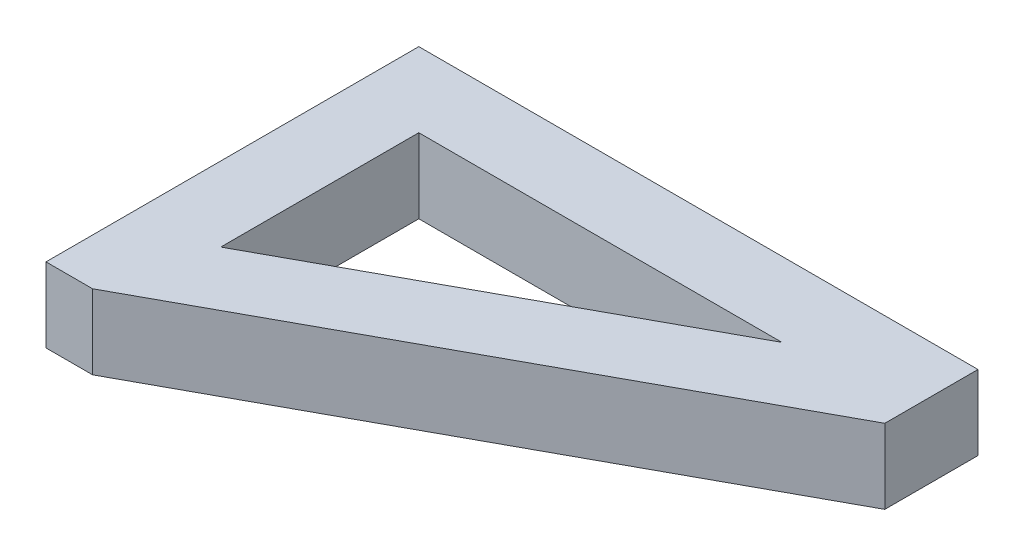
from build123d import *

# Parameters (mm, degrees)
SALIENTE_EXTRUIR1_DEPTH = 20


with BuildPart() as part:
    # Croquis1 → Saliente-Extruir1 (new body)
    with BuildSketch(Plane(origin=(0, 0, 0), x_dir=(1, 0, 0), z_dir=(0, 1, 0))):
        Polygon((0, 0), (0, 100), (150, 100), (150, 75), (12.5, 0), align=None)
        Polygon((20, 80), (117.400119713, 80), (20, 26.872661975), align=None, mode=Mode.SUBTRACT)
    extrude(amount=SALIENTE_EXTRUIR1_DEPTH)


solid = part.part
